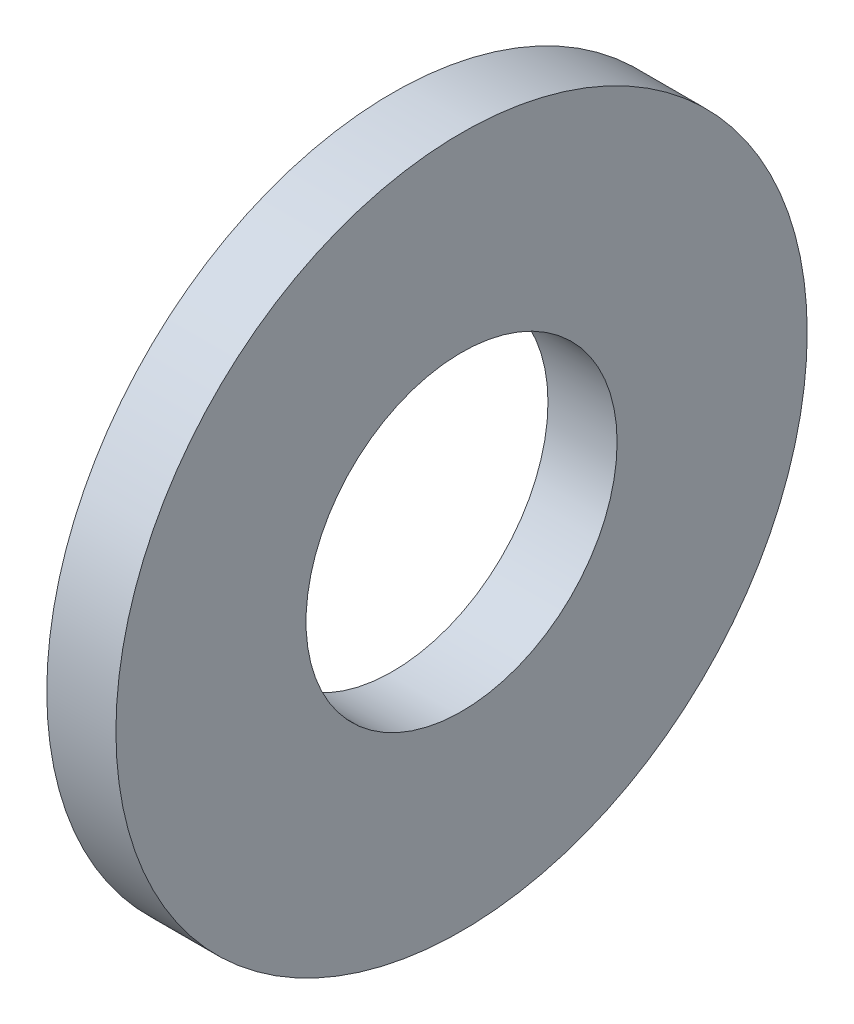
ISO-10303-21;
HEADER;
FILE_DESCRIPTION(('STEP AP214'),'2;1');
FILE_NAME('part.step','',(''),(''),'','','');
FILE_SCHEMA(('AUTOMOTIVE_DESIGN { 1 0 10303 214 1 1 1 1 }'));
ENDSEC;
DATA;
#1=APPLICATION_CONTEXT('core data for automotive mechanical design processes');
#2=APPLICATION_PROTOCOL_DEFINITION('international standard','automotive_design',2000,#1);
#3=PRODUCT_CONTEXT('',#1,'mechanical');
#4=PRODUCT('Part','Part','',(#3));
#5=PRODUCT_RELATED_PRODUCT_CATEGORY('part','',(#4));
#6=PRODUCT_DEFINITION_FORMATION('','',#4);
#7=PRODUCT_DEFINITION_CONTEXT('part definition',#1,'design');
#8=PRODUCT_DEFINITION('design','',#6,#7);
#9=PRODUCT_DEFINITION_SHAPE('','',#8);
#10=(LENGTH_UNIT() NAMED_UNIT(*) SI_UNIT(.MILLI.,.METRE.));
#11=(NAMED_UNIT(*) PLANE_ANGLE_UNIT() SI_UNIT($,.RADIAN.));
#12=(NAMED_UNIT(*) SI_UNIT($,.STERADIAN.) SOLID_ANGLE_UNIT());
#13=UNCERTAINTY_MEASURE_WITH_UNIT(LENGTH_MEASURE(1.E-05),#10,'distance_accuracy_value','');
#14=(GEOMETRIC_REPRESENTATION_CONTEXT(3) GLOBAL_UNCERTAINTY_ASSIGNED_CONTEXT((#13)) GLOBAL_UNIT_ASSIGNED_CONTEXT((#10,
#11,#12)) REPRESENTATION_CONTEXT('',''));
#15=CARTESIAN_POINT('',(0.,0.,0.));
#16=DIRECTION('',(0.,0.,1.));
#17=DIRECTION('',(1.,0.,0.));
#18=AXIS2_PLACEMENT_3D('',#15,#16,#17);
#19=CARTESIAN_POINT('',(0.,0.,0.));
#20=DIRECTION('',(1.,0.,0.));
#21=DIRECTION('',(0.,0.,-1.));
#22=AXIS2_PLACEMENT_3D('',#19,#20,#21);
#23=PLANE('',#22);
#24=CARTESIAN_POINT('',(0.,0.,0.));
#25=DIRECTION('',(1.,0.,0.));
#26=DIRECTION('',(0.,0.,-1.));
#27=AXIS2_PLACEMENT_3D('',#24,#25,#26);
#28=CIRCLE('',#27,2.25);
#29=CARTESIAN_POINT('',(0.,0.,-2.25));
#30=VERTEX_POINT('',#29);
#31=EDGE_CURVE('E27',#30,#30,#28,.T.);
#32=ORIENTED_EDGE('',*,*,#31,.T.);
#33=EDGE_LOOP('',(#32));
#34=FACE_BOUND('',#33,.T.);
#35=CARTESIAN_POINT('',(0.,0.,0.));
#36=DIRECTION('',(1.,0.,0.));
#37=DIRECTION('',(0.,0.,-1.));
#38=AXIS2_PLACEMENT_3D('',#35,#36,#37);
#39=CIRCLE('',#38,5.);
#40=CARTESIAN_POINT('',(0.,0.,-5.));
#41=VERTEX_POINT('',#40);
#42=EDGE_CURVE('E18',#41,#41,#39,.T.);
#43=ORIENTED_EDGE('',*,*,#42,.F.);
#44=EDGE_LOOP('',(#43));
#45=FACE_BOUND('',#44,.T.);
#46=ADVANCED_FACE('F14',(#34,#45),#23,.F.);
#47=CARTESIAN_POINT('',(0.,0.,0.));
#48=DIRECTION('',(1.,0.,0.));
#49=DIRECTION('',(0.,0.,-1.));
#50=AXIS2_PLACEMENT_3D('',#47,#48,#49);
#51=CYLINDRICAL_SURFACE('',#50,5.);
#52=CARTESIAN_POINT('',(1.,0.,0.));
#53=DIRECTION('',(1.,0.,0.));
#54=DIRECTION('',(0.,0.,-1.));
#55=AXIS2_PLACEMENT_3D('',#52,#53,#54);
#56=CIRCLE('',#55,5.);
#57=CARTESIAN_POINT('',(1.,0.,-5.));
#58=VERTEX_POINT('',#57);
#59=EDGE_CURVE('E22',#58,#58,#56,.T.);
#60=ORIENTED_EDGE('',*,*,#59,.F.);
#61=EDGE_LOOP('',(#60));
#62=FACE_BOUND('',#61,.T.);
#63=ORIENTED_EDGE('',*,*,#42,.T.);
#64=EDGE_LOOP('',(#63));
#65=FACE_BOUND('',#64,.T.);
#66=ADVANCED_FACE('F35',(#62,#65),#51,.T.);
#67=CARTESIAN_POINT('',(0.,0.,0.));
#68=DIRECTION('',(1.,0.,0.));
#69=DIRECTION('',(0.,0.,-1.));
#70=AXIS2_PLACEMENT_3D('',#67,#68,#69);
#71=CYLINDRICAL_SURFACE('',#70,2.25);
#72=CARTESIAN_POINT('',(1.,0.,0.));
#73=DIRECTION('',(1.,0.,0.));
#74=DIRECTION('',(0.,0.,-1.));
#75=AXIS2_PLACEMENT_3D('',#72,#73,#74);
#76=CIRCLE('',#75,2.25);
#77=CARTESIAN_POINT('',(1.,0.,-2.25));
#78=VERTEX_POINT('',#77);
#79=EDGE_CURVE('E10',#78,#78,#76,.F.);
#80=ORIENTED_EDGE('',*,*,#79,.F.);
#81=EDGE_LOOP('',(#80));
#82=FACE_BOUND('',#81,.T.);
#83=ORIENTED_EDGE('',*,*,#31,.F.);
#84=EDGE_LOOP('',(#83));
#85=FACE_BOUND('',#84,.T.);
#86=ADVANCED_FACE('F43',(#82,#85),#71,.F.);
#87=CARTESIAN_POINT('',(1.,0.,0.));
#88=DIRECTION('',(1.,0.,0.));
#89=DIRECTION('',(0.,0.,-1.));
#90=AXIS2_PLACEMENT_3D('',#87,#88,#89);
#91=PLANE('',#90);
#92=ORIENTED_EDGE('',*,*,#79,.T.);
#93=EDGE_LOOP('',(#92));
#94=FACE_BOUND('',#93,.T.);
#95=ORIENTED_EDGE('',*,*,#59,.T.);
#96=EDGE_LOOP('',(#95));
#97=FACE_BOUND('',#96,.T.);
#98=ADVANCED_FACE('F16',(#94,#97),#91,.T.);
#99=CLOSED_SHELL('',(#46,#66,#86,#98));
#100=MANIFOLD_SOLID_BREP('B1',#99);
#101=ADVANCED_BREP_SHAPE_REPRESENTATION('',(#18,#100),#14);
#102=SHAPE_DEFINITION_REPRESENTATION(#9,#101);
ENDSEC;
END-ISO-10303-21;
